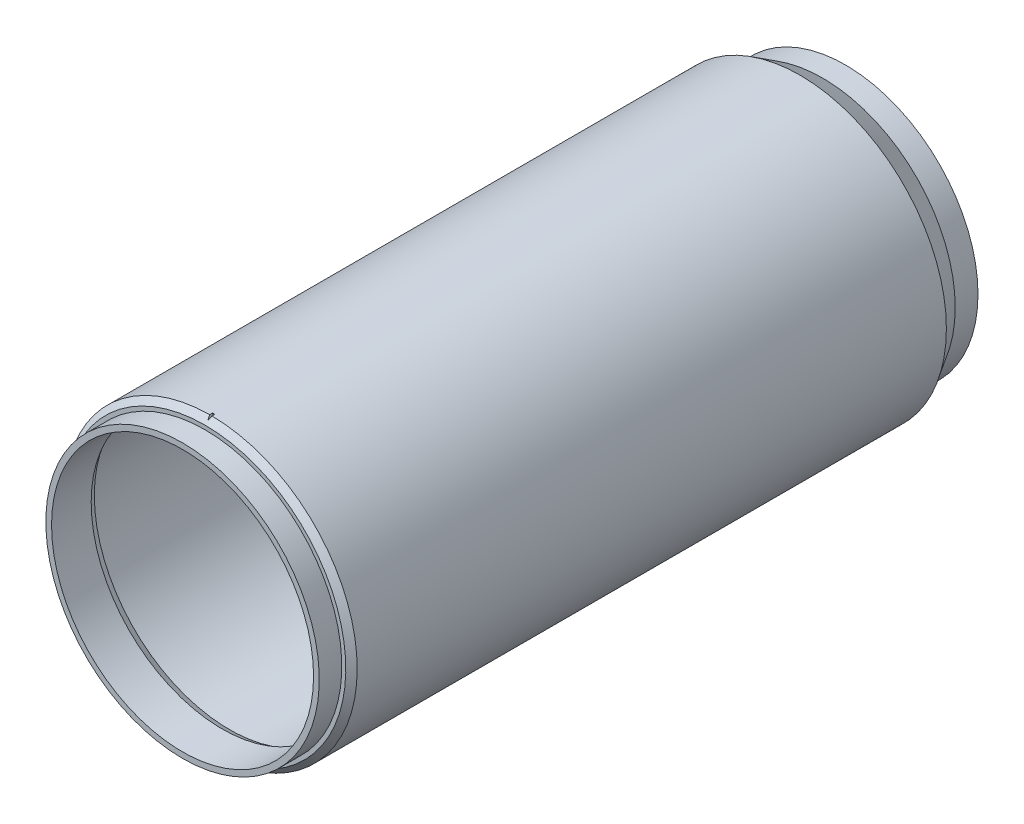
ISO-10303-21;
HEADER;
FILE_DESCRIPTION(('STEP AP214'),'2;1');
FILE_NAME('part.step','',(''),(''),'','','');
FILE_SCHEMA(('AUTOMOTIVE_DESIGN { 1 0 10303 214 1 1 1 1 }'));
ENDSEC;
DATA;
#1=APPLICATION_CONTEXT('core data for automotive mechanical design processes');
#2=APPLICATION_PROTOCOL_DEFINITION('international standard','automotive_design',2000,#1);
#3=PRODUCT_CONTEXT('',#1,'mechanical');
#4=PRODUCT('Part','Part','',(#3));
#5=PRODUCT_RELATED_PRODUCT_CATEGORY('part','',(#4));
#6=PRODUCT_DEFINITION_FORMATION('','',#4);
#7=PRODUCT_DEFINITION_CONTEXT('part definition',#1,'design');
#8=PRODUCT_DEFINITION('design','',#6,#7);
#9=PRODUCT_DEFINITION_SHAPE('','',#8);
#10=(LENGTH_UNIT() NAMED_UNIT(*) SI_UNIT(.MILLI.,.METRE.));
#11=(NAMED_UNIT(*) PLANE_ANGLE_UNIT() SI_UNIT($,.RADIAN.));
#12=(NAMED_UNIT(*) SI_UNIT($,.STERADIAN.) SOLID_ANGLE_UNIT());
#13=UNCERTAINTY_MEASURE_WITH_UNIT(LENGTH_MEASURE(1.E-05),#10,'distance_accuracy_value','');
#14=(GEOMETRIC_REPRESENTATION_CONTEXT(3) GLOBAL_UNCERTAINTY_ASSIGNED_CONTEXT((#13)) GLOBAL_UNIT_ASSIGNED_CONTEXT((#10,
#11,#12)) REPRESENTATION_CONTEXT('',''));
#15=CARTESIAN_POINT('',(0.,0.,0.));
#16=DIRECTION('',(0.,0.,1.));
#17=DIRECTION('',(1.,0.,0.));
#18=AXIS2_PLACEMENT_3D('',#15,#16,#17);
#19=CARTESIAN_POINT('',(0.,0.,0.));
#20=DIRECTION('',(0.,0.,-1.));
#21=DIRECTION('',(0.,1.,0.));
#22=AXIS2_PLACEMENT_3D('',#19,#20,#21);
#23=CYLINDRICAL_SURFACE('',#22,81.5975);
#24=CARTESIAN_POINT('',(0.,0.,361.3531));
#25=DIRECTION('',(0.,0.,1.));
#26=DIRECTION('',(1.,0.,0.));
#27=AXIS2_PLACEMENT_3D('',#24,#25,#26);
#28=CIRCLE('',#27,81.5975);
#29=CARTESIAN_POINT('',(0.661713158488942,81.5948168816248,361.3531));
#30=VERTEX_POINT('',#29);
#31=CARTESIAN_POINT('',(-0.661713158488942,81.5948168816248,361.3531));
#32=VERTEX_POINT('',#31);
#33=EDGE_CURVE('E132',#30,#32,#28,.T.);
#34=ORIENTED_EDGE('',*,*,#33,.F.);
#35=DIRECTION('',(0.,0.,-1.));
#36=VECTOR('',#35,1.);
#37=CARTESIAN_POINT('',(0.661713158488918,81.5948168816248,0.));
#38=LINE('',#37,#36);
#39=CARTESIAN_POINT('',(0.661713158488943,81.5948168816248,362.9406));
#40=VERTEX_POINT('',#39);
#41=EDGE_CURVE('E145',#30,#40,#38,.F.);
#42=ORIENTED_EDGE('',*,*,#41,.T.);
#43=CARTESIAN_POINT('',(0.,0.,362.9406));
#44=DIRECTION('',(0.,0.,-1.));
#45=DIRECTION('',(0.,1.,0.));
#46=AXIS2_PLACEMENT_3D('',#43,#44,#45);
#47=CIRCLE('',#46,81.5975);
#48=CARTESIAN_POINT('',(-0.661713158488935,81.5948168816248,362.9406));
#49=VERTEX_POINT('',#48);
#50=EDGE_CURVE('E258',#40,#49,#47,.T.);
#51=ORIENTED_EDGE('',*,*,#50,.T.);
#52=DIRECTION('',(0.,0.,-1.));
#53=VECTOR('',#52,1.);
#54=CARTESIAN_POINT('',(-0.661713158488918,81.5948168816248,0.));
#55=LINE('',#54,#53);
#56=EDGE_CURVE('E85',#49,#32,#55,.T.);
#57=ORIENTED_EDGE('',*,*,#56,.T.);
#58=EDGE_LOOP('',(#34,#42,#51,#57));
#59=FACE_BOUND('',#58,.T.);
#60=CARTESIAN_POINT('',(0.,0.,34.5186));
#61=DIRECTION('',(0.,0.,1.));
#62=DIRECTION('',(1.,0.,0.));
#63=AXIS2_PLACEMENT_3D('',#60,#61,#62);
#64=CIRCLE('',#63,81.5975);
#65=CARTESIAN_POINT('',(81.5975,0.,34.5186));
#66=VERTEX_POINT('',#65);
#67=EDGE_CURVE('E170',#66,#66,#64,.T.);
#68=ORIENTED_EDGE('',*,*,#67,.T.);
#69=EDGE_LOOP('',(#68));
#70=FACE_BOUND('',#69,.T.);
#71=ADVANCED_FACE('F68',(#59,#70),#23,.T.);
#72=CARTESIAN_POINT('',(0.,50.4323932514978,9.1186));
#73=DIRECTION('',(0.,0.,-1.));
#74=DIRECTION('',(-1.,0.,0.));
#75=AXIS2_PLACEMENT_3D('',#72,#73,#74);
#76=PLANE('',#75);
#77=CARTESIAN_POINT('',(0.,0.,9.1186));
#78=DIRECTION('',(0.,0.,-1.));
#79=DIRECTION('',(-1.,0.,0.));
#80=AXIS2_PLACEMENT_3D('',#77,#78,#79);
#81=CIRCLE('',#80,57.7278027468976);
#82=CARTESIAN_POINT('',(-57.7278027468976,0.,9.1186));
#83=VERTEX_POINT('',#82);
#84=EDGE_CURVE('E78',#83,#83,#81,.F.);
#85=ORIENTED_EDGE('',*,*,#84,.T.);
#86=EDGE_LOOP('',(#85));
#87=FACE_BOUND('',#86,.T.);
#88=CARTESIAN_POINT('',(0.,66.6749999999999,9.1186));
#89=DIRECTION('',(0.,0.,-1.));
#90=DIRECTION('',(-1.,0.,0.));
#91=AXIS2_PLACEMENT_3D('',#88,#89,#90);
#92=CIRCLE('',#91,2.01929999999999);
#93=CARTESIAN_POINT('',(-2.01929999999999,66.6749999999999,9.1186));
#94=VERTEX_POINT('',#93);
#95=EDGE_CURVE('E234',#94,#94,#92,.T.);
#96=ORIENTED_EDGE('',*,*,#95,.F.);
#97=EDGE_LOOP('',(#96));
#98=FACE_BOUND('',#97,.T.);
#99=CARTESIAN_POINT('',(-47.1463446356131,47.1463446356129,9.1186));
#100=DIRECTION('',(0.,0.,-1.));
#101=DIRECTION('',(0.,1.,0.));
#102=AXIS2_PLACEMENT_3D('',#99,#100,#101);
#103=CIRCLE('',#102,2.01929999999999);
#104=CARTESIAN_POINT('',(-47.1463446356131,49.1656446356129,9.1186));
#105=VERTEX_POINT('',#104);
#106=EDGE_CURVE('E226',#105,#105,#103,.T.);
#107=ORIENTED_EDGE('',*,*,#106,.F.);
#108=EDGE_LOOP('',(#107));
#109=FACE_BOUND('',#108,.T.);
#110=CARTESIAN_POINT('',(-66.6749999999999,-2.31677811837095E-13,9.11860000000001));
#111=DIRECTION('',(0.,0.,-1.));
#112=DIRECTION('',(0.,1.,0.));
#113=AXIS2_PLACEMENT_3D('',#110,#111,#112);
#114=CIRCLE('',#113,2.01929999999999);
#115=CARTESIAN_POINT('',(-66.6749999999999,2.01929999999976,9.11860000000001));
#116=VERTEX_POINT('',#115);
#117=EDGE_CURVE('E218',#116,#116,#114,.T.);
#118=ORIENTED_EDGE('',*,*,#117,.F.);
#119=EDGE_LOOP('',(#118));
#120=FACE_BOUND('',#119,.T.);
#121=CARTESIAN_POINT('',(-47.1463446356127,-47.1463446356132,9.11860000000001));
#122=DIRECTION('',(0.,0.,-1.));
#123=DIRECTION('',(0.,1.,0.));
#124=AXIS2_PLACEMENT_3D('',#121,#122,#123);
#125=CIRCLE('',#124,2.01929999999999);
#126=CARTESIAN_POINT('',(-47.1463446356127,-45.1270446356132,9.11860000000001));
#127=VERTEX_POINT('',#126);
#128=EDGE_CURVE('E210',#127,#127,#125,.T.);
#129=ORIENTED_EDGE('',*,*,#128,.F.);
#130=EDGE_LOOP('',(#129));
#131=FACE_BOUND('',#130,.T.);
#132=CARTESIAN_POINT('',(0.,-66.6749999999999,9.11860000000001));
#133=DIRECTION('',(0.,0.,-1.));
#134=DIRECTION('',(0.,1.,0.));
#135=AXIS2_PLACEMENT_3D('',#132,#133,#134);
#136=CIRCLE('',#135,2.01929999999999);
#137=CARTESIAN_POINT('',(0.,-64.6556999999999,9.11860000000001));
#138=VERTEX_POINT('',#137);
#139=EDGE_CURVE('E202',#138,#138,#136,.T.);
#140=ORIENTED_EDGE('',*,*,#139,.F.);
#141=EDGE_LOOP('',(#140));
#142=FACE_BOUND('',#141,.T.);
#143=CARTESIAN_POINT('',(47.1463446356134,-47.1463446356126,9.11860000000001));
#144=DIRECTION('',(0.,0.,-1.));
#145=DIRECTION('',(0.,1.,0.));
#146=AXIS2_PLACEMENT_3D('',#143,#144,#145);
#147=CIRCLE('',#146,2.01929999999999);
#148=CARTESIAN_POINT('',(47.1463446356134,-45.1270446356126,9.11860000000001));
#149=VERTEX_POINT('',#148);
#150=EDGE_CURVE('E194',#149,#149,#147,.T.);
#151=ORIENTED_EDGE('',*,*,#150,.F.);
#152=EDGE_LOOP('',(#151));
#153=FACE_BOUND('',#152,.T.);
#154=CARTESIAN_POINT('',(66.6749999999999,6.99500261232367E-13,9.11860000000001));
#155=DIRECTION('',(0.,0.,-1.));
#156=DIRECTION('',(0.,1.,0.));
#157=AXIS2_PLACEMENT_3D('',#154,#155,#156);
#158=CIRCLE('',#157,2.01929999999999);
#159=CARTESIAN_POINT('',(66.6749999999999,2.01930000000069,9.11860000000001));
#160=VERTEX_POINT('',#159);
#161=EDGE_CURVE('E186',#160,#160,#158,.T.);
#162=ORIENTED_EDGE('',*,*,#161,.F.);
#163=EDGE_LOOP('',(#162));
#164=FACE_BOUND('',#163,.T.);
#165=CARTESIAN_POINT('',(47.1463446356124,47.1463446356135,9.1186));
#166=DIRECTION('',(0.,0.,-1.));
#167=DIRECTION('',(0.,1.,0.));
#168=AXIS2_PLACEMENT_3D('',#165,#166,#167);
#169=CIRCLE('',#168,2.01929999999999);
#170=CARTESIAN_POINT('',(47.1463446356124,49.1656446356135,9.1186));
#171=VERTEX_POINT('',#170);
#172=EDGE_CURVE('E178',#171,#171,#169,.T.);
#173=ORIENTED_EDGE('',*,*,#172,.F.);
#174=EDGE_LOOP('',(#173));
#175=FACE_BOUND('',#174,.T.);
#176=CARTESIAN_POINT('',(0.,0.,9.1186));
#177=DIRECTION('',(0.,0.,1.));
#178=DIRECTION('',(1.,0.,0.));
#179=AXIS2_PLACEMENT_3D('',#176,#177,#178);
#180=CIRCLE('',#179,73.81875);
#181=CARTESIAN_POINT('',(73.81875,0.,9.1186));
#182=VERTEX_POINT('',#181);
#183=EDGE_CURVE('E174',#182,#182,#180,.T.);
#184=ORIENTED_EDGE('',*,*,#183,.F.);
#185=EDGE_LOOP('',(#184));
#186=FACE_BOUND('',#185,.T.);
#187=ADVANCED_FACE('F367',(#87,#98,#109,#120,#131,#142,#153,#164,#175,#186),#76,.T.);
#188=CARTESIAN_POINT('',(0.,0.,0.));
#189=DIRECTION('',(0.,0.,1.));
#190=DIRECTION('',(1.,0.,0.));
#191=AXIS2_PLACEMENT_3D('',#188,#189,#190);
#192=CYLINDRICAL_SURFACE('',#191,57.15);
#193=CARTESIAN_POINT('',(0.,0.,10.7061));
#194=DIRECTION('',(0.,0.,-1.));
#195=DIRECTION('',(-1.,0.,0.));
#196=AXIS2_PLACEMENT_3D('',#193,#194,#195);
#197=CIRCLE('',#196,57.15);
#198=CARTESIAN_POINT('',(-57.15,0.,10.7061));
#199=VERTEX_POINT('',#198);
#200=EDGE_CURVE('E12',#199,#199,#197,.T.);
#201=ORIENTED_EDGE('',*,*,#200,.T.);
#202=EDGE_LOOP('',(#201));
#203=FACE_BOUND('',#202,.T.);
#204=CARTESIAN_POINT('',(0.,0.,23.495));
#205=DIRECTION('',(0.,0.,1.));
#206=DIRECTION('',(1.,0.,0.));
#207=AXIS2_PLACEMENT_3D('',#204,#205,#206);
#208=CIRCLE('',#207,57.15);
#209=CARTESIAN_POINT('',(57.15,0.,23.495));
#210=VERTEX_POINT('',#209);
#211=EDGE_CURVE('E250',#210,#210,#208,.T.);
#212=ORIENTED_EDGE('',*,*,#211,.T.);
#213=EDGE_LOOP('',(#212));
#214=FACE_BOUND('',#213,.T.);
#215=ADVANCED_FACE('F370',(#203,#214),#192,.F.);
#216=CARTESIAN_POINT('',(0.,0.,378.6886));
#217=DIRECTION('',(0.,0.,-1.));
#218=DIRECTION('',(-1.,0.,0.));
#219=AXIS2_PLACEMENT_3D('',#216,#217,#218);
#220=CYLINDRICAL_SURFACE('',#219,73.025);
#221=CARTESIAN_POINT('',(0.,0.,356.5906));
#222=DIRECTION('',(0.,0.,-1.));
#223=DIRECTION('',(-1.,0.,0.));
#224=AXIS2_PLACEMENT_3D('',#221,#222,#223);
#225=CIRCLE('',#224,73.025);
#226=CARTESIAN_POINT('',(-73.025,0.,356.5906));
#227=VERTEX_POINT('',#226);
#228=EDGE_CURVE('E154',#227,#227,#225,.T.);
#229=ORIENTED_EDGE('',*,*,#228,.T.);
#230=EDGE_LOOP('',(#229));
#231=FACE_BOUND('',#230,.T.);
#232=CARTESIAN_POINT('',(0.,0.,378.6886));
#233=DIRECTION('',(0.,0.,1.));
#234=DIRECTION('',(1.,0.,0.));
#235=AXIS2_PLACEMENT_3D('',#232,#233,#234);
#236=CIRCLE('',#235,73.025);
#237=CARTESIAN_POINT('',(73.025,0.,378.6886));
#238=VERTEX_POINT('',#237);
#239=EDGE_CURVE('E254',#238,#238,#236,.T.);
#240=ORIENTED_EDGE('',*,*,#239,.T.);
#241=EDGE_LOOP('',(#240));
#242=FACE_BOUND('',#241,.T.);
#243=ADVANCED_FACE('F390',(#231,#242),#220,.F.);
#244=CARTESIAN_POINT('',(0.,0.,378.6886));
#245=DIRECTION('',(0.,0.,1.));
#246=DIRECTION('',(1.,0.,0.));
#247=AXIS2_PLACEMENT_3D('',#244,#245,#246);
#248=PLANE('',#247);
#249=CARTESIAN_POINT('',(0.,0.,378.6886));
#250=DIRECTION('',(0.,0.,-1.));
#251=DIRECTION('',(0.,1.,0.));
#252=AXIS2_PLACEMENT_3D('',#249,#250,#251);
#253=CIRCLE('',#252,76.2);
#254=CARTESIAN_POINT('',(0.,76.2,378.6886));
#255=VERTEX_POINT('',#254);
#256=EDGE_CURVE('E242',#255,#255,#253,.T.);
#257=ORIENTED_EDGE('',*,*,#256,.F.);
#258=EDGE_LOOP('',(#257));
#259=FACE_BOUND('',#258,.T.);
#260=ORIENTED_EDGE('',*,*,#239,.F.);
#261=EDGE_LOOP('',(#260));
#262=FACE_BOUND('',#261,.T.);
#263=ADVANCED_FACE('F386',(#259,#262),#248,.T.);
#264=CARTESIAN_POINT('',(0.,0.,39.37));
#265=DIRECTION('',(0.,0.,1.));
#266=DIRECTION('',(1.,0.,0.));
#267=AXIS2_PLACEMENT_3D('',#264,#265,#266);
#268=CONICAL_SURFACE('',#267,73.025,0.785398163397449);
#269=ORIENTED_EDGE('',*,*,#211,.F.);
#270=EDGE_LOOP('',(#269));
#271=FACE_BOUND('',#270,.T.);
#272=CARTESIAN_POINT('',(0.,0.,41.75125));
#273=DIRECTION('',(0.,0.,-1.));
#274=DIRECTION('',(-1.,0.,0.));
#275=AXIS2_PLACEMENT_3D('',#272,#273,#274);
#276=CIRCLE('',#275,75.40625);
#277=CARTESIAN_POINT('',(-75.40625,0.,41.75125));
#278=VERTEX_POINT('',#277);
#279=EDGE_CURVE('E162',#278,#278,#276,.T.);
#280=ORIENTED_EDGE('',*,*,#279,.F.);
#281=EDGE_LOOP('',(#280));
#282=FACE_BOUND('',#281,.T.);
#283=ADVANCED_FACE('F379',(#271,#282),#268,.F.);
#284=CARTESIAN_POINT('',(0.,-81.5975,366.1156));
#285=DIRECTION('',(0.,0.,-1.));
#286=DIRECTION('',(0.,1.,0.));
#287=AXIS2_PLACEMENT_3D('',#284,#285,#286);
#288=PLANE('',#287);
#289=CARTESIAN_POINT('',(0.,0.,366.1156));
#290=DIRECTION('',(0.,0.,-1.));
#291=DIRECTION('',(0.,1.,0.));
#292=AXIS2_PLACEMENT_3D('',#289,#290,#291);
#293=CIRCLE('',#292,78.4225000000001);
#294=CARTESIAN_POINT('',(0.,78.4225000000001,366.1156));
#295=VERTEX_POINT('',#294);
#296=EDGE_CURVE('E262',#295,#295,#293,.F.);
#297=ORIENTED_EDGE('',*,*,#296,.T.);
#298=EDGE_LOOP('',(#297));
#299=FACE_BOUND('',#298,.T.);
#300=CARTESIAN_POINT('',(0.,0.,366.1156));
#301=DIRECTION('',(0.,0.,-1.));
#302=DIRECTION('',(0.,1.,0.));
#303=AXIS2_PLACEMENT_3D('',#300,#301,#302);
#304=CIRCLE('',#303,76.2);
#305=CARTESIAN_POINT('',(0.,76.2,366.1156));
#306=VERTEX_POINT('',#305);
#307=EDGE_CURVE('E246',#306,#306,#304,.T.);
#308=ORIENTED_EDGE('',*,*,#307,.T.);
#309=EDGE_LOOP('',(#308));
#310=FACE_BOUND('',#309,.T.);
#311=ADVANCED_FACE('F375',(#299,#310),#288,.F.);
#312=CARTESIAN_POINT('',(0.,0.,0.));
#313=DIRECTION('',(0.,0.,-1.));
#314=DIRECTION('',(0.,1.,0.));
#315=AXIS2_PLACEMENT_3D('',#312,#313,#314);
#316=CYLINDRICAL_SURFACE('',#315,76.2);
#317=ORIENTED_EDGE('',*,*,#307,.F.);
#318=EDGE_LOOP('',(#317));
#319=FACE_BOUND('',#318,.T.);
#320=ORIENTED_EDGE('',*,*,#256,.T.);
#321=EDGE_LOOP('',(#320));
#322=FACE_BOUND('',#321,.T.);
#323=ADVANCED_FACE('F372',(#319,#322),#316,.T.);
#324=CARTESIAN_POINT('',(0.,0.,362.9406));
#325=DIRECTION('',(0.,0.,-1.));
#326=DIRECTION('',(0.,1.,0.));
#327=AXIS2_PLACEMENT_3D('',#324,#325,#326);
#328=CONICAL_SURFACE('',#327,81.5975,0.785398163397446);
#329=CARTESIAN_POINT('',(-8.28427124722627E-05,79.9971000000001,364.540999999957));
#330=CARTESIAN_POINT('',(0.110314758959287,80.2636233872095,364.274471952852));
#331=CARTESIAN_POINT('',(0.22067010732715,80.5300447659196,364.007824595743));
#332=CARTESIAN_POINT('',(0.441296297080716,81.0626835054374,363.474291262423));
#333=CARTESIAN_POINT('',(0.551567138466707,81.3289008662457,363.207405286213));
#334=CARTESIAN_POINT('',(0.661795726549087,81.5950162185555,362.9404));
#335=B_SPLINE_CURVE_WITH_KNOTS('',3,(#329,#330,#331,#332,#333,#334),.UNSPECIFIED.,.F.,.F.,(4,2,
4),(0.,1.17827636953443,2.35655273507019),.UNSPECIFIED.);
#336=CARTESIAN_POINT('',(0.,79.9973000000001,364.5408));
#337=VERTEX_POINT('',#336);
#338=EDGE_CURVE('E273',#337,#40,#335,.T.);
#339=ORIENTED_EDGE('',*,*,#338,.F.);
#340=CARTESIAN_POINT('',(-0.661795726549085,81.5950162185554,362.9404));
#341=CARTESIAN_POINT('',(-0.551567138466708,81.3289008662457,363.207405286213));
#342=CARTESIAN_POINT('',(-0.441296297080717,81.0626835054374,363.474291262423));
#343=CARTESIAN_POINT('',(-0.220670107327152,80.5300447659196,364.007824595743));
#344=CARTESIAN_POINT('',(-0.110314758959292,80.2636233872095,364.274471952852));
#345=CARTESIAN_POINT('',(8.28427124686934E-05,79.9971000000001,364.540999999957));
#346=B_SPLINE_CURVE_WITH_KNOTS('',3,(#340,#341,#342,#343,#344,#345),.UNSPECIFIED.,.F.,.F.,(4,2,
4),(0.,1.1782763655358,2.35655273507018),.UNSPECIFIED.);
#347=EDGE_CURVE('E138',#49,#337,#346,.T.);
#348=ORIENTED_EDGE('',*,*,#347,.F.);
#349=ORIENTED_EDGE('',*,*,#50,.F.);
#350=EDGE_LOOP('',(#339,#348,#349));
#351=FACE_BOUND('',#350,.T.);
#352=ORIENTED_EDGE('',*,*,#296,.F.);
#353=EDGE_LOOP('',(#352));
#354=FACE_BOUND('',#353,.T.);
#355=ADVANCED_FACE('F280',(#351,#354),#328,.T.);
#356=CARTESIAN_POINT('',(0.,66.6749999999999,21.1836));
#357=DIRECTION('',(0.,0.,-1.));
#358=DIRECTION('',(-1.,0.,0.));
#359=AXIS2_PLACEMENT_3D('',#356,#357,#358);
#360=CONICAL_SURFACE('',#359,2.0193,1.02974425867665);
#361=CARTESIAN_POINT('',(0.,66.6749999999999,22.3969178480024));
#362=VERTEX_POINT('',#361);
#363=VERTEX_LOOP('',#362);
#364=FACE_BOUND('',#363,.T.);
#365=CARTESIAN_POINT('',(0.,66.6749999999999,21.1836));
#366=DIRECTION('',(0.,0.,-1.));
#367=DIRECTION('',(-1.,0.,0.));
#368=AXIS2_PLACEMENT_3D('',#365,#366,#367);
#369=CIRCLE('',#368,2.0193);
#370=CARTESIAN_POINT('',(-2.0193,66.6749999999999,21.1836));
#371=VERTEX_POINT('',#370);
#372=EDGE_CURVE('E238',#371,#371,#369,.T.);
#373=ORIENTED_EDGE('',*,*,#372,.T.);
#374=EDGE_LOOP('',(#373));
#375=FACE_BOUND('',#374,.T.);
#376=ADVANCED_FACE('F363',(#364,#375),#360,.F.);
#377=CARTESIAN_POINT('',(0.,66.6749999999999,9.1186));
#378=DIRECTION('',(0.,0.,-1.));
#379=DIRECTION('',(-1.,0.,0.));
#380=AXIS2_PLACEMENT_3D('',#377,#378,#379);
#381=CYLINDRICAL_SURFACE('',#380,2.01929999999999);
#382=ORIENTED_EDGE('',*,*,#372,.F.);
#383=EDGE_LOOP('',(#382));
#384=FACE_BOUND('',#383,.T.);
#385=ORIENTED_EDGE('',*,*,#95,.T.);
#386=EDGE_LOOP('',(#385));
#387=FACE_BOUND('',#386,.T.);
#388=ADVANCED_FACE('F359',(#384,#387),#381,.F.);
#389=CARTESIAN_POINT('',(-47.1463446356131,47.1463446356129,21.1836));
#390=DIRECTION('',(0.,0.,-1.));
#391=DIRECTION('',(0.,1.,0.));
#392=AXIS2_PLACEMENT_3D('',#389,#390,#391);
#393=CONICAL_SURFACE('',#392,2.01929999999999,1.02974425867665);
#394=CARTESIAN_POINT('',(-47.1463446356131,47.1463446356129,22.3969178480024));
#395=VERTEX_POINT('',#394);
#396=VERTEX_LOOP('',#395);
#397=FACE_BOUND('',#396,.T.);
#398=CARTESIAN_POINT('',(-47.1463446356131,47.1463446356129,21.1836));
#399=DIRECTION('',(0.,0.,-1.));
#400=DIRECTION('',(0.,1.,0.));
#401=AXIS2_PLACEMENT_3D('',#398,#399,#400);
#402=CIRCLE('',#401,2.01929999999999);
#403=CARTESIAN_POINT('',(-47.1463446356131,49.1656446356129,21.1836));
#404=VERTEX_POINT('',#403);
#405=EDGE_CURVE('E230',#404,#404,#402,.T.);
#406=ORIENTED_EDGE('',*,*,#405,.T.);
#407=EDGE_LOOP('',(#406));
#408=FACE_BOUND('',#407,.T.);
#409=ADVANCED_FACE('F355',(#397,#408),#393,.F.);
#410=CARTESIAN_POINT('',(-47.1463446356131,47.1463446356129,9.1186));
#411=DIRECTION('',(0.,0.,-1.));
#412=DIRECTION('',(0.,1.,0.));
#413=AXIS2_PLACEMENT_3D('',#410,#411,#412);
#414=CYLINDRICAL_SURFACE('',#413,2.01929999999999);
#415=ORIENTED_EDGE('',*,*,#405,.F.);
#416=EDGE_LOOP('',(#415));
#417=FACE_BOUND('',#416,.T.);
#418=ORIENTED_EDGE('',*,*,#106,.T.);
#419=EDGE_LOOP('',(#418));
#420=FACE_BOUND('',#419,.T.);
#421=ADVANCED_FACE('F351',(#417,#420),#414,.F.);
#422=CARTESIAN_POINT('',(-66.6749999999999,-2.30200275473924E-13,21.1836));
#423=DIRECTION('',(0.,0.,-1.));
#424=DIRECTION('',(0.,1.,0.));
#425=AXIS2_PLACEMENT_3D('',#422,#423,#424);
#426=CONICAL_SURFACE('',#425,2.0193,1.02974425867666);
#427=CARTESIAN_POINT('',(-66.6749999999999,-2.30051686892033E-13,22.3969178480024));
#428=VERTEX_POINT('',#427);
#429=VERTEX_LOOP('',#428);
#430=FACE_BOUND('',#429,.T.);
#431=CARTESIAN_POINT('',(-66.6749999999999,-2.30200275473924E-13,21.1836));
#432=DIRECTION('',(0.,0.,-1.));
#433=DIRECTION('',(0.,1.,0.));
#434=AXIS2_PLACEMENT_3D('',#431,#432,#433);
#435=CIRCLE('',#434,2.0193);
#436=CARTESIAN_POINT('',(-66.6749999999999,2.01929999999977,21.1836));
#437=VERTEX_POINT('',#436);
#438=EDGE_CURVE('E222',#437,#437,#435,.T.);
#439=ORIENTED_EDGE('',*,*,#438,.T.);
#440=EDGE_LOOP('',(#439));
#441=FACE_BOUND('',#440,.T.);
#442=ADVANCED_FACE('F347',(#430,#441),#426,.F.);
#443=CARTESIAN_POINT('',(-66.6749999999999,-2.31677811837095E-13,9.11860000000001));
#444=DIRECTION('',(0.,0.,-1.));
#445=DIRECTION('',(0.,1.,0.));
#446=AXIS2_PLACEMENT_3D('',#443,#444,#445);
#447=CYLINDRICAL_SURFACE('',#446,2.01929999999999);
#448=ORIENTED_EDGE('',*,*,#438,.F.);
#449=EDGE_LOOP('',(#448));
#450=FACE_BOUND('',#449,.T.);
#451=ORIENTED_EDGE('',*,*,#117,.T.);
#452=EDGE_LOOP('',(#451));
#453=FACE_BOUND('',#452,.T.);
#454=ADVANCED_FACE('F343',(#450,#453),#447,.F.);
#455=CARTESIAN_POINT('',(-47.1463446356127,-47.1463446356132,21.1836));
#456=DIRECTION('',(0.,0.,-1.));
#457=DIRECTION('',(0.,1.,0.));
#458=AXIS2_PLACEMENT_3D('',#455,#456,#457);
#459=CONICAL_SURFACE('',#458,2.01929999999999,1.02974425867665);
#460=CARTESIAN_POINT('',(-47.1463446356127,-47.1463446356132,22.3969178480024));
#461=VERTEX_POINT('',#460);
#462=VERTEX_LOOP('',#461);
#463=FACE_BOUND('',#462,.T.);
#464=CARTESIAN_POINT('',(-47.1463446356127,-47.1463446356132,21.1836));
#465=DIRECTION('',(0.,0.,-1.));
#466=DIRECTION('',(0.,1.,0.));
#467=AXIS2_PLACEMENT_3D('',#464,#465,#466);
#468=CIRCLE('',#467,2.01929999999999);
#469=CARTESIAN_POINT('',(-47.1463446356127,-45.1270446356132,21.1836));
#470=VERTEX_POINT('',#469);
#471=EDGE_CURVE('E214',#470,#470,#468,.T.);
#472=ORIENTED_EDGE('',*,*,#471,.T.);
#473=EDGE_LOOP('',(#472));
#474=FACE_BOUND('',#473,.T.);
#475=ADVANCED_FACE('F339',(#463,#474),#459,.F.);
#476=CARTESIAN_POINT('',(-47.1463446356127,-47.1463446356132,9.11860000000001));
#477=DIRECTION('',(0.,0.,-1.));
#478=DIRECTION('',(0.,1.,0.));
#479=AXIS2_PLACEMENT_3D('',#476,#477,#478);
#480=CYLINDRICAL_SURFACE('',#479,2.01929999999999);
#481=ORIENTED_EDGE('',*,*,#471,.F.);
#482=EDGE_LOOP('',(#481));
#483=FACE_BOUND('',#482,.T.);
#484=ORIENTED_EDGE('',*,*,#128,.T.);
#485=EDGE_LOOP('',(#484));
#486=FACE_BOUND('',#485,.T.);
#487=ADVANCED_FACE('F335',(#483,#486),#480,.F.);
#488=CARTESIAN_POINT('',(0.,-66.6749999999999,21.1836));
#489=DIRECTION('',(0.,0.,-1.));
#490=DIRECTION('',(0.,1.,0.));
#491=AXIS2_PLACEMENT_3D('',#488,#489,#490);
#492=CONICAL_SURFACE('',#491,2.0193,1.02974425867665);
#493=CARTESIAN_POINT('',(0.,-66.6749999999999,22.3969178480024));
#494=VERTEX_POINT('',#493);
#495=VERTEX_LOOP('',#494);
#496=FACE_BOUND('',#495,.T.);
#497=CARTESIAN_POINT('',(0.,-66.6749999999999,21.1836));
#498=DIRECTION('',(0.,0.,-1.));
#499=DIRECTION('',(0.,1.,0.));
#500=AXIS2_PLACEMENT_3D('',#497,#498,#499);
#501=CIRCLE('',#500,2.0193);
#502=CARTESIAN_POINT('',(0.,-64.6556999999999,21.1836));
#503=VERTEX_POINT('',#502);
#504=EDGE_CURVE('E206',#503,#503,#501,.T.);
#505=ORIENTED_EDGE('',*,*,#504,.T.);
#506=EDGE_LOOP('',(#505));
#507=FACE_BOUND('',#506,.T.);
#508=ADVANCED_FACE('F331',(#496,#507),#492,.F.);
#509=CARTESIAN_POINT('',(0.,-66.6749999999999,9.11860000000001));
#510=DIRECTION('',(0.,0.,-1.));
#511=DIRECTION('',(0.,1.,0.));
#512=AXIS2_PLACEMENT_3D('',#509,#510,#511);
#513=CYLINDRICAL_SURFACE('',#512,2.01929999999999);
#514=ORIENTED_EDGE('',*,*,#504,.F.);
#515=EDGE_LOOP('',(#514));
#516=FACE_BOUND('',#515,.T.);
#517=ORIENTED_EDGE('',*,*,#139,.T.);
#518=EDGE_LOOP('',(#517));
#519=FACE_BOUND('',#518,.T.);
#520=ADVANCED_FACE('F327',(#516,#519),#513,.F.);
#521=CARTESIAN_POINT('',(47.1463446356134,-47.1463446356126,21.1836));
#522=DIRECTION('',(0.,0.,-1.));
#523=DIRECTION('',(0.,1.,0.));
#524=AXIS2_PLACEMENT_3D('',#521,#522,#523);
#525=CONICAL_SURFACE('',#524,2.01929999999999,1.02974425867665);
#526=CARTESIAN_POINT('',(47.1463446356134,-47.1463446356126,22.3969178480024));
#527=VERTEX_POINT('',#526);
#528=VERTEX_LOOP('',#527);
#529=FACE_BOUND('',#528,.T.);
#530=CARTESIAN_POINT('',(47.1463446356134,-47.1463446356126,21.1836));
#531=DIRECTION('',(0.,0.,-1.));
#532=DIRECTION('',(0.,1.,0.));
#533=AXIS2_PLACEMENT_3D('',#530,#531,#532);
#534=CIRCLE('',#533,2.01929999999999);
#535=CARTESIAN_POINT('',(47.1463446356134,-45.1270446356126,21.1836));
#536=VERTEX_POINT('',#535);
#537=EDGE_CURVE('E198',#536,#536,#534,.T.);
#538=ORIENTED_EDGE('',*,*,#537,.T.);
#539=EDGE_LOOP('',(#538));
#540=FACE_BOUND('',#539,.T.);
#541=ADVANCED_FACE('F323',(#529,#540),#525,.F.);
#542=CARTESIAN_POINT('',(47.1463446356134,-47.1463446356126,9.11860000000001));
#543=DIRECTION('',(0.,0.,-1.));
#544=DIRECTION('',(0.,1.,0.));
#545=AXIS2_PLACEMENT_3D('',#542,#543,#544);
#546=CYLINDRICAL_SURFACE('',#545,2.01929999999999);
#547=ORIENTED_EDGE('',*,*,#537,.F.);
#548=EDGE_LOOP('',(#547));
#549=FACE_BOUND('',#548,.T.);
#550=ORIENTED_EDGE('',*,*,#150,.T.);
#551=EDGE_LOOP('',(#550));
#552=FACE_BOUND('',#551,.T.);
#553=ADVANCED_FACE('F319',(#549,#552),#546,.F.);
#554=CARTESIAN_POINT('',(66.6749999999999,7.00977797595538E-13,21.1836));
#555=DIRECTION('',(0.,0.,-1.));
#556=DIRECTION('',(0.,1.,0.));
#557=AXIS2_PLACEMENT_3D('',#554,#555,#556);
#558=CONICAL_SURFACE('',#557,2.0193,1.02974425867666);
#559=CARTESIAN_POINT('',(66.6749999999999,7.01126386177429E-13,22.3969178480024));
#560=VERTEX_POINT('',#559);
#561=VERTEX_LOOP('',#560);
#562=FACE_BOUND('',#561,.T.);
#563=CARTESIAN_POINT('',(66.6749999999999,7.00977797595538E-13,21.1836));
#564=DIRECTION('',(0.,0.,-1.));
#565=DIRECTION('',(0.,1.,0.));
#566=AXIS2_PLACEMENT_3D('',#563,#564,#565);
#567=CIRCLE('',#566,2.0193);
#568=CARTESIAN_POINT('',(66.6749999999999,2.0193000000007,21.1836));
#569=VERTEX_POINT('',#568);
#570=EDGE_CURVE('E190',#569,#569,#567,.T.);
#571=ORIENTED_EDGE('',*,*,#570,.T.);
#572=EDGE_LOOP('',(#571));
#573=FACE_BOUND('',#572,.T.);
#574=ADVANCED_FACE('F315',(#562,#573),#558,.F.);
#575=CARTESIAN_POINT('',(66.6749999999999,6.99500261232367E-13,9.11860000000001));
#576=DIRECTION('',(0.,0.,-1.));
#577=DIRECTION('',(0.,1.,0.));
#578=AXIS2_PLACEMENT_3D('',#575,#576,#577);
#579=CYLINDRICAL_SURFACE('',#578,2.01929999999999);
#580=ORIENTED_EDGE('',*,*,#570,.F.);
#581=EDGE_LOOP('',(#580));
#582=FACE_BOUND('',#581,.T.);
#583=ORIENTED_EDGE('',*,*,#161,.T.);
#584=EDGE_LOOP('',(#583));
#585=FACE_BOUND('',#584,.T.);
#586=ADVANCED_FACE('F311',(#582,#585),#579,.F.);
#587=CARTESIAN_POINT('',(47.1463446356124,47.1463446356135,21.1836));
#588=DIRECTION('',(0.,0.,-1.));
#589=DIRECTION('',(0.,1.,0.));
#590=AXIS2_PLACEMENT_3D('',#587,#588,#589);
#591=CONICAL_SURFACE('',#590,2.01929999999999,1.02974425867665);
#592=CARTESIAN_POINT('',(47.1463446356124,47.1463446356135,22.3969178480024));
#593=VERTEX_POINT('',#592);
#594=VERTEX_LOOP('',#593);
#595=FACE_BOUND('',#594,.T.);
#596=CARTESIAN_POINT('',(47.1463446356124,47.1463446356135,21.1836));
#597=DIRECTION('',(0.,0.,-1.));
#598=DIRECTION('',(0.,1.,0.));
#599=AXIS2_PLACEMENT_3D('',#596,#597,#598);
#600=CIRCLE('',#599,2.01929999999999);
#601=CARTESIAN_POINT('',(47.1463446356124,49.1656446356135,21.1836));
#602=VERTEX_POINT('',#601);
#603=EDGE_CURVE('E182',#602,#602,#600,.T.);
#604=ORIENTED_EDGE('',*,*,#603,.T.);
#605=EDGE_LOOP('',(#604));
#606=FACE_BOUND('',#605,.T.);
#607=ADVANCED_FACE('F307',(#595,#606),#591,.F.);
#608=CARTESIAN_POINT('',(47.1463446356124,47.1463446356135,9.1186));
#609=DIRECTION('',(0.,0.,-1.));
#610=DIRECTION('',(0.,1.,0.));
#611=AXIS2_PLACEMENT_3D('',#608,#609,#610);
#612=CYLINDRICAL_SURFACE('',#611,2.01929999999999);
#613=ORIENTED_EDGE('',*,*,#603,.F.);
#614=EDGE_LOOP('',(#613));
#615=FACE_BOUND('',#614,.T.);
#616=ORIENTED_EDGE('',*,*,#172,.T.);
#617=EDGE_LOOP('',(#616));
#618=FACE_BOUND('',#617,.T.);
#619=ADVANCED_FACE('F303',(#615,#618),#612,.F.);
#620=CARTESIAN_POINT('',(0.,0.,0.));
#621=DIRECTION('',(0.,0.,1.));
#622=DIRECTION('',(1.,0.,0.));
#623=AXIS2_PLACEMENT_3D('',#620,#621,#622);
#624=CYLINDRICAL_SURFACE('',#623,73.81875);
#625=ORIENTED_EDGE('',*,*,#183,.T.);
#626=EDGE_LOOP('',(#625));
#627=FACE_BOUND('',#626,.T.);
#628=CARTESIAN_POINT('',(0.,0.,21.8186));
#629=DIRECTION('',(0.,0.,1.));
#630=DIRECTION('',(1.,0.,0.));
#631=AXIS2_PLACEMENT_3D('',#628,#629,#630);
#632=CIRCLE('',#631,73.81875);
#633=CARTESIAN_POINT('',(73.81875,0.,21.8186));
#634=VERTEX_POINT('',#633);
#635=EDGE_CURVE('E166',#634,#634,#632,.T.);
#636=ORIENTED_EDGE('',*,*,#635,.F.);
#637=EDGE_LOOP('',(#636));
#638=FACE_BOUND('',#637,.T.);
#639=ADVANCED_FACE('F299',(#627,#638),#624,.T.);
#640=CARTESIAN_POINT('',(0.,0.,34.5186));
#641=DIRECTION('',(0.,0.,1.));
#642=DIRECTION('',(1.,0.,0.));
#643=AXIS2_PLACEMENT_3D('',#640,#641,#642);
#644=CONICAL_SURFACE('',#643,81.5975,0.549560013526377);
#645=ORIENTED_EDGE('',*,*,#635,.T.);
#646=EDGE_LOOP('',(#645));
#647=FACE_BOUND('',#646,.T.);
#648=ORIENTED_EDGE('',*,*,#67,.F.);
#649=EDGE_LOOP('',(#648));
#650=FACE_BOUND('',#649,.T.);
#651=ADVANCED_FACE('F295',(#647,#650),#644,.T.);
#652=CARTESIAN_POINT('',(0.,0.,0.));
#653=DIRECTION('',(0.,0.,-1.));
#654=DIRECTION('',(-1.,0.,0.));
#655=AXIS2_PLACEMENT_3D('',#652,#653,#654);
#656=CYLINDRICAL_SURFACE('',#655,75.40625);
#657=CARTESIAN_POINT('',(0.,0.,352.466154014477));
#658=DIRECTION('',(0.,0.,-1.));
#659=DIRECTION('',(-1.,0.,0.));
#660=AXIS2_PLACEMENT_3D('',#657,#658,#659);
#661=CIRCLE('',#660,75.40625);
#662=CARTESIAN_POINT('',(-75.40625,0.,352.466154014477));
#663=VERTEX_POINT('',#662);
#664=EDGE_CURVE('E158',#663,#663,#661,.T.);
#665=ORIENTED_EDGE('',*,*,#664,.F.);
#666=EDGE_LOOP('',(#665));
#667=FACE_BOUND('',#666,.T.);
#668=ORIENTED_EDGE('',*,*,#279,.T.);
#669=EDGE_LOOP('',(#668));
#670=FACE_BOUND('',#669,.T.);
#671=ADVANCED_FACE('F291',(#667,#670),#656,.F.);
#672=CARTESIAN_POINT('',(0.,0.,352.466154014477));
#673=DIRECTION('',(0.,0.,-1.));
#674=DIRECTION('',(-1.,0.,0.));
#675=AXIS2_PLACEMENT_3D('',#672,#673,#674);
#676=CONICAL_SURFACE('',#675,75.40625,0.523598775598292);
#677=ORIENTED_EDGE('',*,*,#228,.F.);
#678=EDGE_LOOP('',(#677));
#679=FACE_BOUND('',#678,.T.);
#680=ORIENTED_EDGE('',*,*,#664,.T.);
#681=EDGE_LOOP('',(#680));
#682=FACE_BOUND('',#681,.T.);
#683=ADVANCED_FACE('F288',(#679,#682),#676,.F.);
#684=CARTESIAN_POINT('',(0.,0.,361.3531));
#685=DIRECTION('',(0.,0.,1.));
#686=DIRECTION('',(1.,0.,0.));
#687=AXIS2_PLACEMENT_3D('',#684,#685,#686);
#688=PLANE('',#687);
#689=ORIENTED_EDGE('',*,*,#33,.T.);
#690=DIRECTION('',(0.382683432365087,-0.923879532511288,0.));
#691=VECTOR('',#690,1.);
#692=CARTESIAN_POINT('',(-1.57056006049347,83.7889673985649,361.3531));
#693=LINE('',#692,#691);
#694=CARTESIAN_POINT('',(0.,79.9973000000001,361.3531));
#695=VERTEX_POINT('',#694);
#696=EDGE_CURVE('E126',#32,#695,#693,.T.);
#697=ORIENTED_EDGE('',*,*,#696,.T.);
#698=DIRECTION('',(0.382683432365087,0.923879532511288,0.));
#699=VECTOR('',#698,1.);
#700=CARTESIAN_POINT('',(0.,79.9973000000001,361.3531));
#701=LINE('',#700,#699);
#702=EDGE_CURVE('E130',#695,#30,#701,.T.);
#703=ORIENTED_EDGE('',*,*,#702,.T.);
#704=EDGE_LOOP('',(#689,#697,#703));
#705=FACE_BOUND('',#704,.T.);
#706=ADVANCED_FACE('F128',(#705),#688,.T.);
#707=CARTESIAN_POINT('',(0.,79.9973000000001,361.3531));
#708=DIRECTION('',(0.923879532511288,-0.382683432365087,0.));
#709=DIRECTION('',(0.382683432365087,0.923879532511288,0.));
#710=AXIS2_PLACEMENT_3D('',#707,#708,#709);
#711=PLANE('',#710);
#712=ORIENTED_EDGE('',*,*,#702,.F.);
#713=DIRECTION('',(0.,0.,1.));
#714=VECTOR('',#713,1.);
#715=CARTESIAN_POINT('',(0.,79.9973000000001,361.3531));
#716=LINE('',#715,#714);
#717=EDGE_CURVE('E136',#695,#337,#716,.T.);
#718=ORIENTED_EDGE('',*,*,#717,.T.);
#719=ORIENTED_EDGE('',*,*,#338,.T.);
#720=ORIENTED_EDGE('',*,*,#41,.F.);
#721=EDGE_LOOP('',(#712,#718,#719,#720));
#722=FACE_BOUND('',#721,.T.);
#723=ADVANCED_FACE('F143',(#722),#711,.F.);
#724=CARTESIAN_POINT('',(-1.57056006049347,83.7889673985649,361.3531));
#725=DIRECTION('',(-0.923879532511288,-0.382683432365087,0.));
#726=DIRECTION('',(0.382683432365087,-0.923879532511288,0.));
#727=AXIS2_PLACEMENT_3D('',#724,#725,#726);
#728=PLANE('',#727);
#729=ORIENTED_EDGE('',*,*,#347,.T.);
#730=ORIENTED_EDGE('',*,*,#717,.F.);
#731=ORIENTED_EDGE('',*,*,#696,.F.);
#732=ORIENTED_EDGE('',*,*,#56,.F.);
#733=EDGE_LOOP('',(#729,#730,#731,#732));
#734=FACE_BOUND('',#733,.T.);
#735=ADVANCED_FACE('F137',(#734),#728,.F.);
#736=CARTESIAN_POINT('',(0.,0.,9.1186));
#737=DIRECTION('',(0.,0.,-1.));
#738=DIRECTION('',(-1.,0.,0.));
#739=AXIS2_PLACEMENT_3D('',#736,#737,#738);
#740=CONICAL_SURFACE('',#739,57.7278027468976,0.34906585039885);
#741=ORIENTED_EDGE('',*,*,#200,.F.);
#742=EDGE_LOOP('',(#741));
#743=FACE_BOUND('',#742,.T.);
#744=ORIENTED_EDGE('',*,*,#84,.F.);
#745=EDGE_LOOP('',(#744));
#746=FACE_BOUND('',#745,.T.);
#747=ADVANCED_FACE('F71',(#743,#746),#740,.F.);
#748=CLOSED_SHELL('',(#71,#187,#215,#243,#263,#283,#311,#323,#355,#376,#388,#409,#421,#442,#454,
#475,#487,#508,#520,#541,#553,#574,#586,#607,#619,#639,#651,#671,#683,#706,#723,#735,#747));
#749=MANIFOLD_SOLID_BREP('B2',#748);
#750=ADVANCED_BREP_SHAPE_REPRESENTATION('',(#18,#749),#14);
#751=SHAPE_DEFINITION_REPRESENTATION(#9,#750);
ENDSEC;
END-ISO-10303-21;
